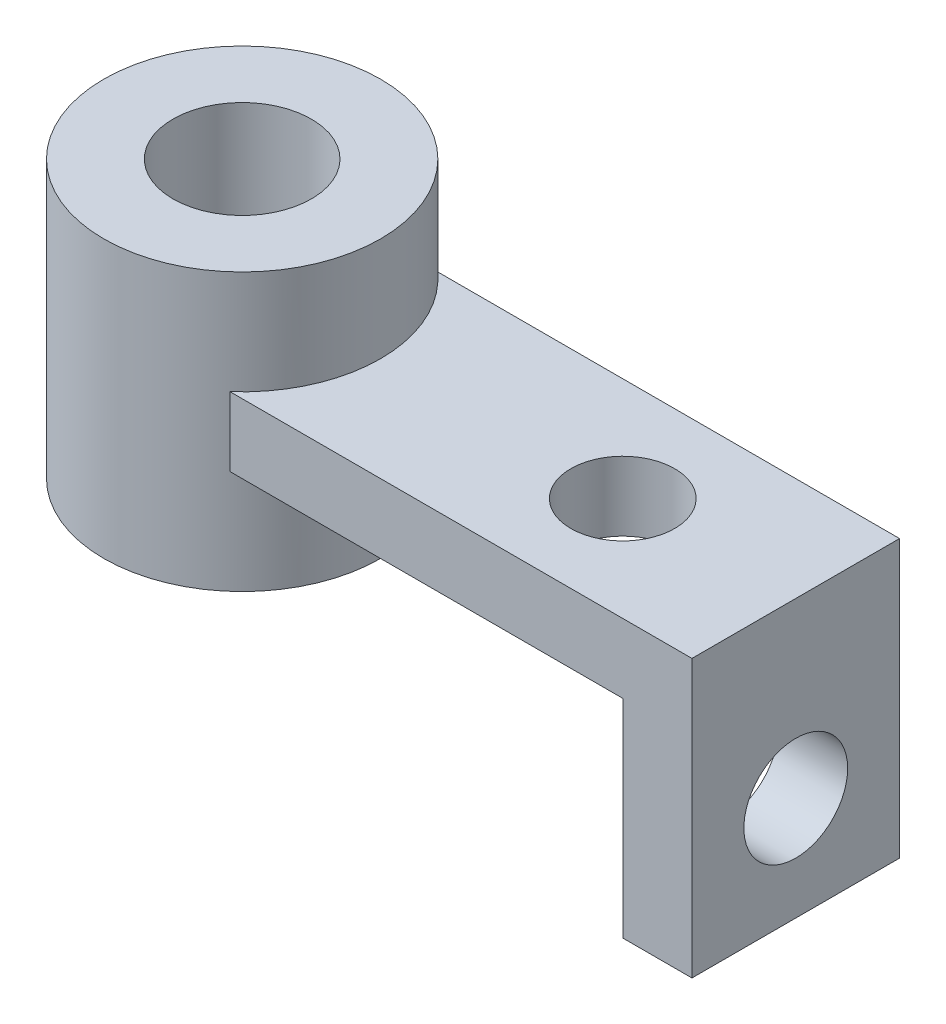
ISO-10303-21;
HEADER;
FILE_DESCRIPTION(('STEP AP214'),'2;1');
FILE_NAME('part.step','',(''),(''),'','','');
FILE_SCHEMA(('AUTOMOTIVE_DESIGN { 1 0 10303 214 1 1 1 1 }'));
ENDSEC;
DATA;
#1=APPLICATION_CONTEXT('core data for automotive mechanical design processes');
#2=APPLICATION_PROTOCOL_DEFINITION('international standard','automotive_design',2000,#1);
#3=PRODUCT_CONTEXT('',#1,'mechanical');
#4=PRODUCT('Part','Part','',(#3));
#5=PRODUCT_RELATED_PRODUCT_CATEGORY('part','',(#4));
#6=PRODUCT_DEFINITION_FORMATION('','',#4);
#7=PRODUCT_DEFINITION_CONTEXT('part definition',#1,'design');
#8=PRODUCT_DEFINITION('design','',#6,#7);
#9=PRODUCT_DEFINITION_SHAPE('','',#8);
#10=(LENGTH_UNIT() NAMED_UNIT(*) SI_UNIT(.MILLI.,.METRE.));
#11=(NAMED_UNIT(*) PLANE_ANGLE_UNIT() SI_UNIT($,.RADIAN.));
#12=(NAMED_UNIT(*) SI_UNIT($,.STERADIAN.) SOLID_ANGLE_UNIT());
#13=UNCERTAINTY_MEASURE_WITH_UNIT(LENGTH_MEASURE(1.E-05),#10,'distance_accuracy_value','');
#14=(GEOMETRIC_REPRESENTATION_CONTEXT(3) GLOBAL_UNCERTAINTY_ASSIGNED_CONTEXT((#13)) GLOBAL_UNIT_ASSIGNED_CONTEXT((#10,
#11,#12)) REPRESENTATION_CONTEXT('',''));
#15=CARTESIAN_POINT('',(0.,0.,0.));
#16=DIRECTION('',(0.,0.,1.));
#17=DIRECTION('',(1.,0.,0.));
#18=AXIS2_PLACEMENT_3D('',#15,#16,#17);
#19=CARTESIAN_POINT('',(0.,-1016.,0.));
#20=DIRECTION('',(0.,1.,0.));
#21=DIRECTION('',(0.,0.,1.));
#22=AXIS2_PLACEMENT_3D('',#19,#20,#21);
#23=CYLINDRICAL_SURFACE('',#22,508.);
#24=CARTESIAN_POINT('',(0.,-381.,0.));
#25=DIRECTION('',(0.,1.,0.));
#26=DIRECTION('',(0.,0.,1.));
#27=AXIS2_PLACEMENT_3D('',#24,#25,#26);
#28=CIRCLE('',#27,508.);
#29=CARTESIAN_POINT('',(336.010416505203,-381.,-381.));
#30=VERTEX_POINT('',#29);
#31=CARTESIAN_POINT('',(336.010416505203,-381.,381.));
#32=VERTEX_POINT('',#31);
#33=EDGE_CURVE('E11',#30,#32,#28,.F.);
#34=ORIENTED_EDGE('',*,*,#33,.F.);
#35=DIRECTION('',(0.,1.,0.));
#36=VECTOR('',#35,1.);
#37=CARTESIAN_POINT('',(336.010416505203,-1016.,-381.));
#38=LINE('',#37,#36);
#39=CARTESIAN_POINT('',(336.010416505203,-635.,-381.));
#40=VERTEX_POINT('',#39);
#41=EDGE_CURVE('E55',#30,#40,#38,.F.);
#42=ORIENTED_EDGE('',*,*,#41,.T.);
#43=CARTESIAN_POINT('',(0.,-635.,0.));
#44=DIRECTION('',(0.,1.,0.));
#45=DIRECTION('',(0.,0.,1.));
#46=AXIS2_PLACEMENT_3D('',#43,#44,#45);
#47=CIRCLE('',#46,508.);
#48=CARTESIAN_POINT('',(336.010416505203,-635.,381.));
#49=VERTEX_POINT('',#48);
#50=EDGE_CURVE('E104',#40,#49,#47,.F.);
#51=ORIENTED_EDGE('',*,*,#50,.T.);
#52=DIRECTION('',(0.,1.,0.));
#53=VECTOR('',#52,1.);
#54=CARTESIAN_POINT('',(336.010416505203,-1016.,381.));
#55=LINE('',#54,#53);
#56=EDGE_CURVE('E40',#49,#32,#55,.T.);
#57=ORIENTED_EDGE('',*,*,#56,.T.);
#58=EDGE_LOOP('',(#34,#42,#51,#57));
#59=FACE_BOUND('',#58,.T.);
#60=CARTESIAN_POINT('',(0.,-1016.,0.));
#61=DIRECTION('',(0.,1.,0.));
#62=DIRECTION('',(0.,0.,1.));
#63=AXIS2_PLACEMENT_3D('',#60,#61,#62);
#64=CIRCLE('',#63,508.);
#65=CARTESIAN_POINT('',(0.,-1016.,508.));
#66=VERTEX_POINT('',#65);
#67=EDGE_CURVE('E119',#66,#66,#64,.T.);
#68=ORIENTED_EDGE('',*,*,#67,.T.);
#69=EDGE_LOOP('',(#68));
#70=FACE_BOUND('',#69,.T.);
#71=CARTESIAN_POINT('',(0.,0.,0.));
#72=DIRECTION('',(0.,1.,0.));
#73=DIRECTION('',(0.,0.,1.));
#74=AXIS2_PLACEMENT_3D('',#71,#72,#73);
#75=CIRCLE('',#74,508.);
#76=CARTESIAN_POINT('',(0.,0.,508.));
#77=VERTEX_POINT('',#76);
#78=EDGE_CURVE('E118',#77,#77,#75,.T.);
#79=ORIENTED_EDGE('',*,*,#78,.F.);
#80=EDGE_LOOP('',(#79));
#81=FACE_BOUND('',#80,.T.);
#82=ADVANCED_FACE('F33',(#59,#70,#81),#23,.T.);
#83=CARTESIAN_POINT('',(0.,-1016.,0.));
#84=DIRECTION('',(0.,1.,0.));
#85=DIRECTION('',(0.,0.,1.));
#86=AXIS2_PLACEMENT_3D('',#83,#84,#85);
#87=PLANE('',#86);
#88=CARTESIAN_POINT('',(0.,-1016.,0.));
#89=DIRECTION('',(0.,1.,0.));
#90=DIRECTION('',(0.,0.,1.));
#91=AXIS2_PLACEMENT_3D('',#88,#89,#90);
#92=CIRCLE('',#91,254.);
#93=CARTESIAN_POINT('',(0.,-1016.,254.));
#94=VERTEX_POINT('',#93);
#95=EDGE_CURVE('E158',#94,#94,#92,.T.);
#96=ORIENTED_EDGE('',*,*,#95,.T.);
#97=EDGE_LOOP('',(#96));
#98=FACE_BOUND('',#97,.T.);
#99=ORIENTED_EDGE('',*,*,#67,.F.);
#100=EDGE_LOOP('',(#99));
#101=FACE_BOUND('',#100,.T.);
#102=ADVANCED_FACE('F171',(#98,#101),#87,.F.);
#103=CARTESIAN_POINT('',(0.,0.,0.));
#104=DIRECTION('',(0.,1.,0.));
#105=DIRECTION('',(0.,0.,1.));
#106=AXIS2_PLACEMENT_3D('',#103,#104,#105);
#107=PLANE('',#106);
#108=CARTESIAN_POINT('',(0.,0.,0.));
#109=DIRECTION('',(0.,1.,0.));
#110=DIRECTION('',(0.,0.,1.));
#111=AXIS2_PLACEMENT_3D('',#108,#109,#110);
#112=CIRCLE('',#111,254.);
#113=CARTESIAN_POINT('',(0.,0.,254.));
#114=VERTEX_POINT('',#113);
#115=EDGE_CURVE('E161',#114,#114,#112,.T.);
#116=ORIENTED_EDGE('',*,*,#115,.F.);
#117=EDGE_LOOP('',(#116));
#118=FACE_BOUND('',#117,.T.);
#119=ORIENTED_EDGE('',*,*,#78,.T.);
#120=EDGE_LOOP('',(#119));
#121=FACE_BOUND('',#120,.T.);
#122=ADVANCED_FACE('F168',(#118,#121),#107,.T.);
#123=CARTESIAN_POINT('',(0.,-381.,381.));
#124=DIRECTION('',(0.,0.,-1.));
#125=DIRECTION('',(-1.,0.,0.));
#126=AXIS2_PLACEMENT_3D('',#123,#124,#125);
#127=PLANE('',#126);
#128=ORIENTED_EDGE('',*,*,#56,.F.);
#129=DIRECTION('',(1.,0.,0.));
#130=VECTOR('',#129,1.);
#131=CARTESIAN_POINT('',(0.,-635.,381.));
#132=LINE('',#131,#130);
#133=CARTESIAN_POINT('',(1778.,-635.,381.));
#134=VERTEX_POINT('',#133);
#135=EDGE_CURVE('E47',#49,#134,#132,.T.);
#136=ORIENTED_EDGE('',*,*,#135,.T.);
#137=DIRECTION('',(0.,-1.,0.));
#138=VECTOR('',#137,1.);
#139=CARTESIAN_POINT('',(1778.,-1397.,381.));
#140=LINE('',#139,#138);
#141=CARTESIAN_POINT('',(1778.,-1397.,381.));
#142=VERTEX_POINT('',#141);
#143=EDGE_CURVE('E91',#134,#142,#140,.T.);
#144=ORIENTED_EDGE('',*,*,#143,.T.);
#145=DIRECTION('',(1.,0.,0.));
#146=VECTOR('',#145,1.);
#147=CARTESIAN_POINT('',(2032.,-1397.,381.));
#148=LINE('',#147,#146);
#149=CARTESIAN_POINT('',(2032.,-1397.,381.));
#150=VERTEX_POINT('',#149);
#151=EDGE_CURVE('E100',#142,#150,#148,.T.);
#152=ORIENTED_EDGE('',*,*,#151,.T.);
#153=DIRECTION('',(0.,-1.,0.));
#154=VECTOR('',#153,1.);
#155=CARTESIAN_POINT('',(2032.,-381.,381.));
#156=LINE('',#155,#154);
#157=CARTESIAN_POINT('',(2032.,-381.,381.));
#158=VERTEX_POINT('',#157);
#159=EDGE_CURVE('E115',#158,#150,#156,.T.);
#160=ORIENTED_EDGE('',*,*,#159,.F.);
#161=DIRECTION('',(1.,0.,0.));
#162=VECTOR('',#161,1.);
#163=CARTESIAN_POINT('',(0.,-381.,381.));
#164=LINE('',#163,#162);
#165=EDGE_CURVE('E105',#32,#158,#164,.T.);
#166=ORIENTED_EDGE('',*,*,#165,.F.);
#167=EDGE_LOOP('',(#128,#136,#144,#152,#160,#166));
#168=FACE_BOUND('',#167,.T.);
#169=ADVANCED_FACE('F131',(#168),#127,.F.);
#170=CARTESIAN_POINT('',(2032.,-381.,-381.));
#171=DIRECTION('',(-1.,0.,0.));
#172=DIRECTION('',(0.,0.,1.));
#173=AXIS2_PLACEMENT_3D('',#170,#171,#172);
#174=PLANE('',#173);
#175=CARTESIAN_POINT('',(2032.,-1016.,0.));
#176=DIRECTION('',(1.,0.,0.));
#177=DIRECTION('',(0.,0.,-1.));
#178=AXIS2_PLACEMENT_3D('',#175,#176,#177);
#179=CIRCLE('',#178,190.5);
#180=CARTESIAN_POINT('',(2032.,-1016.,-190.5));
#181=VERTEX_POINT('',#180);
#182=EDGE_CURVE('E145',#181,#181,#179,.T.);
#183=ORIENTED_EDGE('',*,*,#182,.F.);
#184=EDGE_LOOP('',(#183));
#185=FACE_BOUND('',#184,.T.);
#186=ORIENTED_EDGE('',*,*,#159,.T.);
#187=DIRECTION('',(0.,0.,1.));
#188=VECTOR('',#187,1.);
#189=CARTESIAN_POINT('',(2032.,-1397.,-381.));
#190=LINE('',#189,#188);
#191=CARTESIAN_POINT('',(2032.,-1397.,-381.));
#192=VERTEX_POINT('',#191);
#193=EDGE_CURVE('E109',#192,#150,#190,.T.);
#194=ORIENTED_EDGE('',*,*,#193,.F.);
#195=DIRECTION('',(0.,-1.,0.));
#196=VECTOR('',#195,1.);
#197=CARTESIAN_POINT('',(2032.,-381.,-381.));
#198=LINE('',#197,#196);
#199=CARTESIAN_POINT('',(2032.,-381.,-381.));
#200=VERTEX_POINT('',#199);
#201=EDGE_CURVE('E113',#200,#192,#198,.T.);
#202=ORIENTED_EDGE('',*,*,#201,.F.);
#203=DIRECTION('',(0.,0.,-1.));
#204=VECTOR('',#203,1.);
#205=CARTESIAN_POINT('',(2032.,-381.,-381.));
#206=LINE('',#205,#204);
#207=EDGE_CURVE('E107',#158,#200,#206,.T.);
#208=ORIENTED_EDGE('',*,*,#207,.F.);
#209=EDGE_LOOP('',(#186,#194,#202,#208));
#210=FACE_BOUND('',#209,.T.);
#211=ADVANCED_FACE('F186',(#185,#210),#174,.F.);
#212=CARTESIAN_POINT('',(0.,-381.,-381.));
#213=DIRECTION('',(0.,0.,1.));
#214=DIRECTION('',(1.,0.,0.));
#215=AXIS2_PLACEMENT_3D('',#212,#213,#214);
#216=PLANE('',#215);
#217=ORIENTED_EDGE('',*,*,#41,.F.);
#218=DIRECTION('',(-1.,0.,0.));
#219=VECTOR('',#218,1.);
#220=CARTESIAN_POINT('',(0.,-381.,-381.));
#221=LINE('',#220,#219);
#222=EDGE_CURVE('E116',#200,#30,#221,.T.);
#223=ORIENTED_EDGE('',*,*,#222,.F.);
#224=ORIENTED_EDGE('',*,*,#201,.T.);
#225=DIRECTION('',(1.,0.,0.));
#226=VECTOR('',#225,1.);
#227=CARTESIAN_POINT('',(2032.,-1397.,-381.));
#228=LINE('',#227,#226);
#229=CARTESIAN_POINT('',(1778.,-1397.,-381.));
#230=VERTEX_POINT('',#229);
#231=EDGE_CURVE('E94',#230,#192,#228,.T.);
#232=ORIENTED_EDGE('',*,*,#231,.F.);
#233=DIRECTION('',(0.,-1.,0.));
#234=VECTOR('',#233,1.);
#235=CARTESIAN_POINT('',(1778.,-1397.,-381.));
#236=LINE('',#235,#234);
#237=CARTESIAN_POINT('',(1778.,-635.,-381.));
#238=VERTEX_POINT('',#237);
#239=EDGE_CURVE('E89',#238,#230,#236,.T.);
#240=ORIENTED_EDGE('',*,*,#239,.F.);
#241=DIRECTION('',(-1.,0.,0.));
#242=VECTOR('',#241,1.);
#243=CARTESIAN_POINT('',(0.,-635.,-381.));
#244=LINE('',#243,#242);
#245=EDGE_CURVE('E98',#238,#40,#244,.T.);
#246=ORIENTED_EDGE('',*,*,#245,.T.);
#247=EDGE_LOOP('',(#217,#223,#224,#232,#240,#246));
#248=FACE_BOUND('',#247,.T.);
#249=ADVANCED_FACE('F97',(#248),#216,.F.);
#250=CARTESIAN_POINT('',(0.,-381.,0.));
#251=DIRECTION('',(0.,1.,0.));
#252=DIRECTION('',(0.,0.,1.));
#253=AXIS2_PLACEMENT_3D('',#250,#251,#252);
#254=PLANE('',#253);
#255=CARTESIAN_POINT('',(1397.,-381.,0.));
#256=DIRECTION('',(0.,1.,0.));
#257=DIRECTION('',(0.,0.,1.));
#258=AXIS2_PLACEMENT_3D('',#255,#256,#257);
#259=CIRCLE('',#258,190.5);
#260=CARTESIAN_POINT('',(1397.,-381.,190.5));
#261=VERTEX_POINT('',#260);
#262=EDGE_CURVE('E155',#261,#261,#259,.T.);
#263=ORIENTED_EDGE('',*,*,#262,.F.);
#264=EDGE_LOOP('',(#263));
#265=FACE_BOUND('',#264,.T.);
#266=ORIENTED_EDGE('',*,*,#222,.T.);
#267=ORIENTED_EDGE('',*,*,#33,.T.);
#268=ORIENTED_EDGE('',*,*,#165,.T.);
#269=ORIENTED_EDGE('',*,*,#207,.T.);
#270=EDGE_LOOP('',(#266,#267,#268,#269));
#271=FACE_BOUND('',#270,.T.);
#272=ADVANCED_FACE('F136',(#265,#271),#254,.T.);
#273=CARTESIAN_POINT('',(0.,-635.,0.));
#274=DIRECTION('',(0.,1.,0.));
#275=DIRECTION('',(0.,0.,1.));
#276=AXIS2_PLACEMENT_3D('',#273,#274,#275);
#277=PLANE('',#276);
#278=CARTESIAN_POINT('',(1397.,-635.,0.));
#279=DIRECTION('',(0.,1.,0.));
#280=DIRECTION('',(0.,0.,1.));
#281=AXIS2_PLACEMENT_3D('',#278,#279,#280);
#282=CIRCLE('',#281,190.5);
#283=CARTESIAN_POINT('',(1397.,-635.,190.5));
#284=VERTEX_POINT('',#283);
#285=EDGE_CURVE('E150',#284,#284,#282,.F.);
#286=ORIENTED_EDGE('',*,*,#285,.F.);
#287=EDGE_LOOP('',(#286));
#288=FACE_BOUND('',#287,.T.);
#289=ORIENTED_EDGE('',*,*,#245,.F.);
#290=DIRECTION('',(0.,0.,1.));
#291=VECTOR('',#290,1.);
#292=CARTESIAN_POINT('',(1778.,-635.,-381.));
#293=LINE('',#292,#291);
#294=EDGE_CURVE('E86',#238,#134,#293,.T.);
#295=ORIENTED_EDGE('',*,*,#294,.T.);
#296=ORIENTED_EDGE('',*,*,#135,.F.);
#297=ORIENTED_EDGE('',*,*,#50,.F.);
#298=EDGE_LOOP('',(#289,#295,#296,#297));
#299=FACE_BOUND('',#298,.T.);
#300=ADVANCED_FACE('F102',(#288,#299),#277,.F.);
#301=CARTESIAN_POINT('',(2032.,-1397.,-381.));
#302=DIRECTION('',(0.,-1.,0.));
#303=DIRECTION('',(0.,0.,-1.));
#304=AXIS2_PLACEMENT_3D('',#301,#302,#303);
#305=PLANE('',#304);
#306=ORIENTED_EDGE('',*,*,#151,.F.);
#307=DIRECTION('',(0.,0.,1.));
#308=VECTOR('',#307,1.);
#309=CARTESIAN_POINT('',(1778.,-1397.,-381.));
#310=LINE('',#309,#308);
#311=EDGE_CURVE('E93',#230,#142,#310,.T.);
#312=ORIENTED_EDGE('',*,*,#311,.F.);
#313=ORIENTED_EDGE('',*,*,#231,.T.);
#314=ORIENTED_EDGE('',*,*,#193,.T.);
#315=EDGE_LOOP('',(#306,#312,#313,#314));
#316=FACE_BOUND('',#315,.T.);
#317=ADVANCED_FACE('F194',(#316),#305,.T.);
#318=CARTESIAN_POINT('',(1778.,-1397.,-381.));
#319=DIRECTION('',(-1.,0.,0.));
#320=DIRECTION('',(0.,0.,1.));
#321=AXIS2_PLACEMENT_3D('',#318,#319,#320);
#322=PLANE('',#321);
#323=CARTESIAN_POINT('',(1778.,-1016.,0.));
#324=DIRECTION('',(-1.,0.,0.));
#325=DIRECTION('',(0.,0.,1.));
#326=AXIS2_PLACEMENT_3D('',#323,#324,#325);
#327=CIRCLE('',#326,190.5);
#328=CARTESIAN_POINT('',(1778.,-1016.,190.5));
#329=VERTEX_POINT('',#328);
#330=EDGE_CURVE('E147',#329,#329,#327,.F.);
#331=ORIENTED_EDGE('',*,*,#330,.T.);
#332=EDGE_LOOP('',(#331));
#333=FACE_BOUND('',#332,.T.);
#334=ORIENTED_EDGE('',*,*,#143,.F.);
#335=ORIENTED_EDGE('',*,*,#294,.F.);
#336=ORIENTED_EDGE('',*,*,#239,.T.);
#337=ORIENTED_EDGE('',*,*,#311,.T.);
#338=EDGE_LOOP('',(#334,#335,#336,#337));
#339=FACE_BOUND('',#338,.T.);
#340=ADVANCED_FACE('F88',(#333,#339),#322,.T.);
#341=CARTESIAN_POINT('',(-508.001,-1016.,0.));
#342=DIRECTION('',(1.,0.,0.));
#343=DIRECTION('',(0.,0.,-1.));
#344=AXIS2_PLACEMENT_3D('',#341,#342,#343);
#345=CYLINDRICAL_SURFACE('',#344,190.5);
#346=ORIENTED_EDGE('',*,*,#330,.F.);
#347=EDGE_LOOP('',(#346));
#348=FACE_BOUND('',#347,.T.);
#349=ORIENTED_EDGE('',*,*,#182,.T.);
#350=EDGE_LOOP('',(#349));
#351=FACE_BOUND('',#350,.T.);
#352=ADVANCED_FACE('F201',(#348,#351),#345,.F.);
#353=CARTESIAN_POINT('',(1397.,-1397.001,0.));
#354=DIRECTION('',(0.,1.,0.));
#355=DIRECTION('',(0.,0.,1.));
#356=AXIS2_PLACEMENT_3D('',#353,#354,#355);
#357=CYLINDRICAL_SURFACE('',#356,190.5);
#358=ORIENTED_EDGE('',*,*,#262,.T.);
#359=EDGE_LOOP('',(#358));
#360=FACE_BOUND('',#359,.T.);
#361=ORIENTED_EDGE('',*,*,#285,.T.);
#362=EDGE_LOOP('',(#361));
#363=FACE_BOUND('',#362,.T.);
#364=ADVANCED_FACE('F208',(#360,#363),#357,.F.);
#365=CARTESIAN_POINT('',(0.,-1397.,0.));
#366=DIRECTION('',(0.,1.,0.));
#367=DIRECTION('',(0.,0.,1.));
#368=AXIS2_PLACEMENT_3D('',#365,#366,#367);
#369=CYLINDRICAL_SURFACE('',#368,254.);
#370=ORIENTED_EDGE('',*,*,#115,.T.);
#371=EDGE_LOOP('',(#370));
#372=FACE_BOUND('',#371,.T.);
#373=ORIENTED_EDGE('',*,*,#95,.F.);
#374=EDGE_LOOP('',(#373));
#375=FACE_BOUND('',#374,.T.);
#376=ADVANCED_FACE('F165',(#372,#375),#369,.F.);
#377=CLOSED_SHELL('',(#82,#102,#122,#169,#211,#249,#272,#300,#317,#340,#352,#364,#376));
#378=MANIFOLD_SOLID_BREP('B2',#377);
#379=ADVANCED_BREP_SHAPE_REPRESENTATION('',(#18,#378),#14);
#380=SHAPE_DEFINITION_REPRESENTATION(#9,#379);
ENDSEC;
END-ISO-10303-21;
